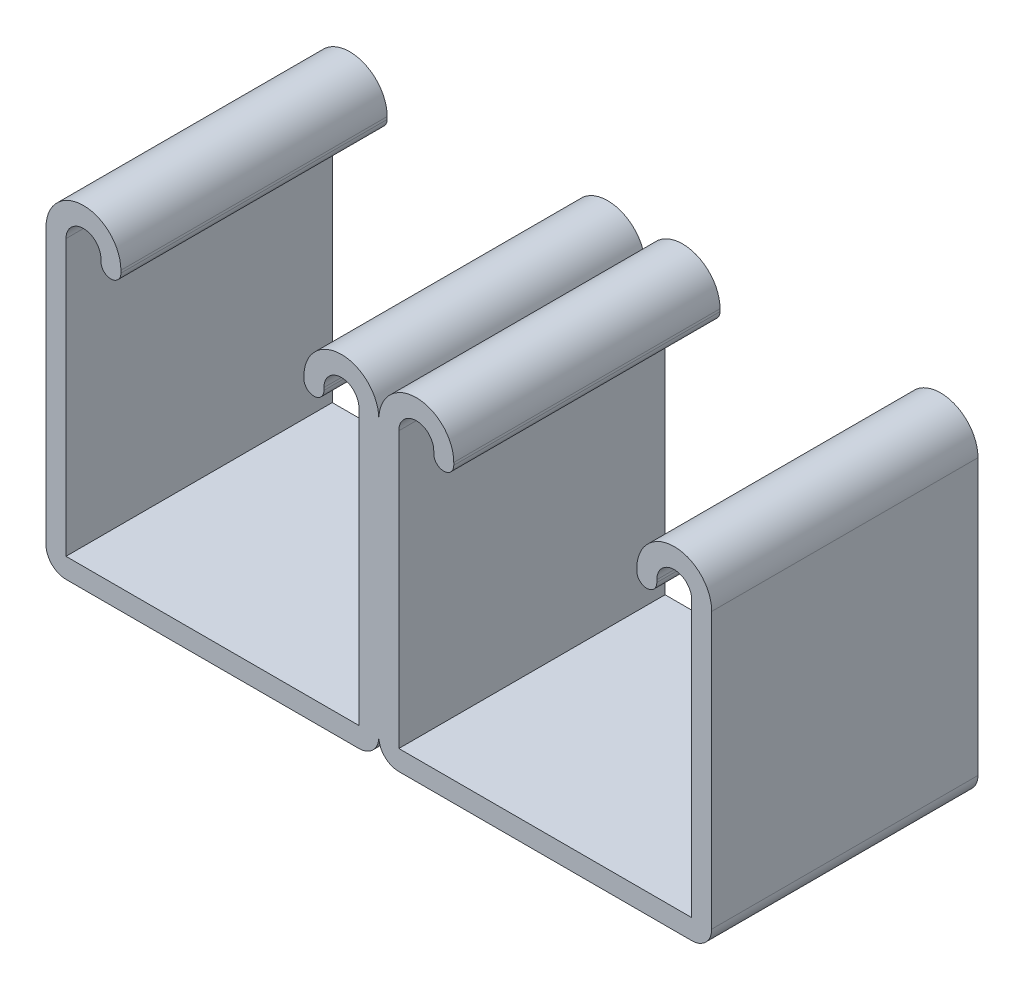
ISO-10303-21;
HEADER;
FILE_DESCRIPTION(('STEP AP214'),'2;1');
FILE_NAME('part.step','',(''),(''),'','','');
FILE_SCHEMA(('AUTOMOTIVE_DESIGN { 1 0 10303 214 1 1 1 1 }'));
ENDSEC;
DATA;
#1=APPLICATION_CONTEXT('core data for automotive mechanical design processes');
#2=APPLICATION_PROTOCOL_DEFINITION('international standard','automotive_design',2000,#1);
#3=PRODUCT_CONTEXT('',#1,'mechanical');
#4=PRODUCT('Part','Part','',(#3));
#5=PRODUCT_RELATED_PRODUCT_CATEGORY('part','',(#4));
#6=PRODUCT_DEFINITION_FORMATION('','',#4);
#7=PRODUCT_DEFINITION_CONTEXT('part definition',#1,'design');
#8=PRODUCT_DEFINITION('design','',#6,#7);
#9=PRODUCT_DEFINITION_SHAPE('','',#8);
#10=(LENGTH_UNIT() NAMED_UNIT(*) SI_UNIT(.MILLI.,.METRE.));
#11=(NAMED_UNIT(*) PLANE_ANGLE_UNIT() SI_UNIT($,.RADIAN.));
#12=(NAMED_UNIT(*) SI_UNIT($,.STERADIAN.) SOLID_ANGLE_UNIT());
#13=UNCERTAINTY_MEASURE_WITH_UNIT(LENGTH_MEASURE(1.E-05),#10,'distance_accuracy_value','');
#14=(GEOMETRIC_REPRESENTATION_CONTEXT(3) GLOBAL_UNCERTAINTY_ASSIGNED_CONTEXT((#13)) GLOBAL_UNIT_ASSIGNED_CONTEXT((#10,
#11,#12)) REPRESENTATION_CONTEXT('',''));
#15=CARTESIAN_POINT('',(0.,0.,0.));
#16=DIRECTION('',(0.,0.,1.));
#17=DIRECTION('',(1.,0.,0.));
#18=AXIS2_PLACEMENT_3D('',#15,#16,#17);
#19=CARTESIAN_POINT('',(-28.178125,14.335125,12.7));
#20=DIRECTION('',(0.,0.,-1.));
#21=DIRECTION('',(-1.,0.,0.));
#22=AXIS2_PLACEMENT_3D('',#19,#20,#21);
#23=CYLINDRICAL_SURFACE('',#22,3.571875);
#24=CARTESIAN_POINT('',(-28.178125,14.335125,-12.7));
#25=DIRECTION('',(0.,0.,1.));
#26=DIRECTION('',(-1.,0.,0.));
#27=AXIS2_PLACEMENT_3D('',#24,#25,#26);
#28=CIRCLE('',#27,3.571875);
#29=CARTESIAN_POINT('',(-24.60625,14.335125,-12.7));
#30=VERTEX_POINT('',#29);
#31=CARTESIAN_POINT('',(-31.75,14.335125,-12.7));
#32=VERTEX_POINT('',#31);
#33=EDGE_CURVE('E190',#30,#32,#28,.T.);
#34=ORIENTED_EDGE('',*,*,#33,.T.);
#35=DIRECTION('',(0.,0.,-1.));
#36=VECTOR('',#35,1.);
#37=CARTESIAN_POINT('',(-31.75,14.335125,12.7));
#38=LINE('',#37,#36);
#39=CARTESIAN_POINT('',(-31.75,14.335125,12.7));
#40=VERTEX_POINT('',#39);
#41=EDGE_CURVE('E11',#40,#32,#38,.T.);
#42=ORIENTED_EDGE('',*,*,#41,.F.);
#43=CARTESIAN_POINT('',(-28.178125,14.335125,12.7));
#44=DIRECTION('',(0.,0.,1.));
#45=DIRECTION('',(-1.,0.,0.));
#46=AXIS2_PLACEMENT_3D('',#43,#44,#45);
#47=CIRCLE('',#46,3.571875);
#48=CARTESIAN_POINT('',(-24.60625,14.335125,12.7));
#49=VERTEX_POINT('',#48);
#50=EDGE_CURVE('E223',#49,#40,#47,.T.);
#51=ORIENTED_EDGE('',*,*,#50,.F.);
#52=DIRECTION('',(0.,0.,-1.));
#53=VECTOR('',#52,1.);
#54=CARTESIAN_POINT('',(-24.60625,14.335125,12.7));
#55=LINE('',#54,#53);
#56=EDGE_CURVE('E186',#49,#30,#55,.T.);
#57=ORIENTED_EDGE('',*,*,#56,.T.);
#58=EDGE_LOOP('',(#34,#42,#51,#57));
#59=FACE_BOUND('',#58,.T.);
#60=ADVANCED_FACE('F33',(#59),#23,.T.);
#61=CARTESIAN_POINT('',(-31.75,14.335125,12.7));
#62=DIRECTION('',(1.,0.,0.));
#63=DIRECTION('',(0.,1.,0.));
#64=AXIS2_PLACEMENT_3D('',#61,#62,#63);
#65=PLANE('',#64);
#66=DIRECTION('',(0.,-1.,0.));
#67=VECTOR('',#66,1.);
#68=CARTESIAN_POINT('',(-31.75,14.335125,-12.7));
#69=LINE('',#68,#67);
#70=CARTESIAN_POINT('',(-31.75,-11.9126,-12.7));
#71=VERTEX_POINT('',#70);
#72=EDGE_CURVE('E193',#32,#71,#69,.T.);
#73=ORIENTED_EDGE('',*,*,#72,.T.);
#74=DIRECTION('',(0.,0.,-1.));
#75=VECTOR('',#74,1.);
#76=CARTESIAN_POINT('',(-31.75,-11.9126,12.7));
#77=LINE('',#76,#75);
#78=CARTESIAN_POINT('',(-31.75,-11.9126,12.7));
#79=VERTEX_POINT('',#78);
#80=EDGE_CURVE('E41',#79,#71,#77,.T.);
#81=ORIENTED_EDGE('',*,*,#80,.F.);
#82=DIRECTION('',(0.,-1.,0.));
#83=VECTOR('',#82,1.);
#84=CARTESIAN_POINT('',(-31.75,14.335125,12.7));
#85=LINE('',#84,#83);
#86=EDGE_CURVE('E120',#40,#79,#85,.T.);
#87=ORIENTED_EDGE('',*,*,#86,.F.);
#88=ORIENTED_EDGE('',*,*,#41,.T.);
#89=EDGE_LOOP('',(#73,#81,#87,#88));
#90=FACE_BOUND('',#89,.T.);
#91=ADVANCED_FACE('F330',(#90),#65,.F.);
#92=CARTESIAN_POINT('',(-29.845,-11.9126,12.7));
#93=DIRECTION('',(0.,0.,-1.));
#94=DIRECTION('',(-1.,0.,0.));
#95=AXIS2_PLACEMENT_3D('',#92,#93,#94);
#96=CYLINDRICAL_SURFACE('',#95,1.905);
#97=CARTESIAN_POINT('',(-29.845,-11.9126,-12.7));
#98=DIRECTION('',(0.,0.,1.));
#99=DIRECTION('',(-1.,0.,0.));
#100=AXIS2_PLACEMENT_3D('',#97,#98,#99);
#101=CIRCLE('',#100,1.905);
#102=CARTESIAN_POINT('',(-29.845,-13.8176,-12.7));
#103=VERTEX_POINT('',#102);
#104=EDGE_CURVE('E196',#71,#103,#101,.T.);
#105=ORIENTED_EDGE('',*,*,#104,.T.);
#106=DIRECTION('',(0.,0.,-1.));
#107=VECTOR('',#106,1.);
#108=CARTESIAN_POINT('',(-29.845,-13.8176,12.7));
#109=LINE('',#108,#107);
#110=CARTESIAN_POINT('',(-29.845,-13.8176,12.7));
#111=VERTEX_POINT('',#110);
#112=EDGE_CURVE('E260',#111,#103,#109,.T.);
#113=ORIENTED_EDGE('',*,*,#112,.F.);
#114=CARTESIAN_POINT('',(-29.845,-11.9126,12.7));
#115=DIRECTION('',(0.,0.,1.));
#116=DIRECTION('',(-1.,0.,0.));
#117=AXIS2_PLACEMENT_3D('',#114,#115,#116);
#118=CIRCLE('',#117,1.905);
#119=EDGE_CURVE('E268',#79,#111,#118,.T.);
#120=ORIENTED_EDGE('',*,*,#119,.F.);
#121=ORIENTED_EDGE('',*,*,#80,.T.);
#122=EDGE_LOOP('',(#105,#113,#120,#121));
#123=FACE_BOUND('',#122,.T.);
#124=ADVANCED_FACE('F266',(#123),#96,.T.);
#125=CARTESIAN_POINT('',(-29.845,-13.8176,12.7));
#126=DIRECTION('',(0.,1.,0.));
#127=DIRECTION('',(0.,0.,1.));
#128=AXIS2_PLACEMENT_3D('',#125,#126,#127);
#129=PLANE('',#128);
#130=DIRECTION('',(1.,0.,0.));
#131=VECTOR('',#130,1.);
#132=CARTESIAN_POINT('',(-29.845,-13.8176,-12.7));
#133=LINE('',#132,#131);
#134=CARTESIAN_POINT('',(-1.905,-13.8176,-12.7));
#135=VERTEX_POINT('',#134);
#136=EDGE_CURVE('E198',#103,#135,#133,.T.);
#137=ORIENTED_EDGE('',*,*,#136,.T.);
#138=DIRECTION('',(0.,0.,-1.));
#139=VECTOR('',#138,1.);
#140=CARTESIAN_POINT('',(-1.905,-13.8176,12.7));
#141=LINE('',#140,#139);
#142=CARTESIAN_POINT('',(-1.905,-13.8176,12.7));
#143=VERTEX_POINT('',#142);
#144=EDGE_CURVE('E257',#143,#135,#141,.T.);
#145=ORIENTED_EDGE('',*,*,#144,.F.);
#146=DIRECTION('',(1.,0.,0.));
#147=VECTOR('',#146,1.);
#148=CARTESIAN_POINT('',(-29.845,-13.8176,12.7));
#149=LINE('',#148,#147);
#150=EDGE_CURVE('E287',#111,#143,#149,.T.);
#151=ORIENTED_EDGE('',*,*,#150,.F.);
#152=ORIENTED_EDGE('',*,*,#112,.T.);
#153=EDGE_LOOP('',(#137,#145,#151,#152));
#154=FACE_BOUND('',#153,.T.);
#155=ADVANCED_FACE('F277',(#154),#129,.F.);
#156=CARTESIAN_POINT('',(-1.905,-11.9126,12.7));
#157=DIRECTION('',(0.,0.,-1.));
#158=DIRECTION('',(-1.,0.,0.));
#159=AXIS2_PLACEMENT_3D('',#156,#157,#158);
#160=CYLINDRICAL_SURFACE('',#159,1.905);
#161=CARTESIAN_POINT('',(-1.905,-11.9126,-12.7));
#162=DIRECTION('',(0.,0.,1.));
#163=DIRECTION('',(1.,0.,0.));
#164=AXIS2_PLACEMENT_3D('',#161,#162,#163);
#165=CIRCLE('',#164,1.905);
#166=CARTESIAN_POINT('',(0.,-11.9126,-12.7));
#167=VERTEX_POINT('',#166);
#168=EDGE_CURVE('E200',#135,#167,#165,.T.);
#169=ORIENTED_EDGE('',*,*,#168,.T.);
#170=DIRECTION('',(0.,0.,-1.));
#171=VECTOR('',#170,1.);
#172=CARTESIAN_POINT('',(0.,-11.9126,12.7));
#173=LINE('',#172,#171);
#174=CARTESIAN_POINT('',(0.,-11.9126,12.7));
#175=VERTEX_POINT('',#174);
#176=EDGE_CURVE('E254',#175,#167,#173,.T.);
#177=ORIENTED_EDGE('',*,*,#176,.F.);
#178=CARTESIAN_POINT('',(-1.905,-11.9126,12.7));
#179=DIRECTION('',(0.,0.,1.));
#180=DIRECTION('',(1.,0.,0.));
#181=AXIS2_PLACEMENT_3D('',#178,#179,#180);
#182=CIRCLE('',#181,1.905);
#183=EDGE_CURVE('E283',#143,#175,#182,.T.);
#184=ORIENTED_EDGE('',*,*,#183,.F.);
#185=ORIENTED_EDGE('',*,*,#144,.T.);
#186=EDGE_LOOP('',(#169,#177,#184,#185));
#187=FACE_BOUND('',#186,.T.);
#188=ADVANCED_FACE('F281',(#187),#160,.T.);
#189=CARTESIAN_POINT('',(-3.571875,14.335125,12.7));
#190=DIRECTION('',(0.,0.,-1.));
#191=DIRECTION('',(-1.,0.,0.));
#192=AXIS2_PLACEMENT_3D('',#189,#190,#191);
#193=CYLINDRICAL_SURFACE('',#192,3.571875);
#194=CARTESIAN_POINT('',(-3.571875,14.335125,-12.7));
#195=DIRECTION('',(0.,0.,1.));
#196=DIRECTION('',(1.,0.,0.));
#197=AXIS2_PLACEMENT_3D('',#194,#195,#196);
#198=CIRCLE('',#197,3.571875);
#199=CARTESIAN_POINT('',(0.,14.335125,-12.7));
#200=VERTEX_POINT('',#199);
#201=CARTESIAN_POINT('',(-7.14375,14.335125,-12.7));
#202=VERTEX_POINT('',#201);
#203=EDGE_CURVE('E202',#200,#202,#198,.T.);
#204=ORIENTED_EDGE('',*,*,#203,.T.);
#205=DIRECTION('',(0.,0.,-1.));
#206=VECTOR('',#205,1.);
#207=CARTESIAN_POINT('',(-7.14375,14.335125,12.7));
#208=LINE('',#207,#206);
#209=CARTESIAN_POINT('',(-7.14375,14.335125,12.7));
#210=VERTEX_POINT('',#209);
#211=EDGE_CURVE('E248',#210,#202,#208,.T.);
#212=ORIENTED_EDGE('',*,*,#211,.F.);
#213=CARTESIAN_POINT('',(-3.571875,14.335125,12.7));
#214=DIRECTION('',(0.,0.,1.));
#215=DIRECTION('',(1.,0.,0.));
#216=AXIS2_PLACEMENT_3D('',#213,#214,#215);
#217=CIRCLE('',#216,3.571875);
#218=CARTESIAN_POINT('',(0.,14.335125,12.7));
#219=VERTEX_POINT('',#218);
#220=EDGE_CURVE('E286',#219,#210,#217,.T.);
#221=ORIENTED_EDGE('',*,*,#220,.F.);
#222=DIRECTION('',(0.,0.,-1.));
#223=VECTOR('',#222,1.);
#224=CARTESIAN_POINT('',(0.,14.335125,12.7));
#225=LINE('',#224,#223);
#226=EDGE_CURVE('E251',#219,#200,#225,.T.);
#227=ORIENTED_EDGE('',*,*,#226,.T.);
#228=EDGE_LOOP('',(#204,#212,#221,#227));
#229=FACE_BOUND('',#228,.T.);
#230=ADVANCED_FACE('F343',(#229),#193,.T.);
#231=CARTESIAN_POINT('',(-7.14375,14.335125,12.7));
#232=DIRECTION('',(1.,0.,0.));
#233=DIRECTION('',(0.,1.,0.));
#234=AXIS2_PLACEMENT_3D('',#231,#232,#233);
#235=PLANE('',#234);
#236=DIRECTION('',(0.,-1.,0.));
#237=VECTOR('',#236,1.);
#238=CARTESIAN_POINT('',(-7.14375,14.335125,-12.7));
#239=LINE('',#238,#237);
#240=CARTESIAN_POINT('',(-7.14375,14.097,-12.7));
#241=VERTEX_POINT('',#240);
#242=EDGE_CURVE('E204',#202,#241,#239,.T.);
#243=ORIENTED_EDGE('',*,*,#242,.T.);
#244=DIRECTION('',(0.,0.,-1.));
#245=VECTOR('',#244,1.);
#246=CARTESIAN_POINT('',(-7.14375,14.097,12.7));
#247=LINE('',#246,#245);
#248=CARTESIAN_POINT('',(-7.14375,14.097,12.7));
#249=VERTEX_POINT('',#248);
#250=EDGE_CURVE('E245',#249,#241,#247,.T.);
#251=ORIENTED_EDGE('',*,*,#250,.F.);
#252=DIRECTION('',(0.,-1.,0.));
#253=VECTOR('',#252,1.);
#254=CARTESIAN_POINT('',(-7.14375,14.335125,12.7));
#255=LINE('',#254,#253);
#256=EDGE_CURVE('E289',#210,#249,#255,.T.);
#257=ORIENTED_EDGE('',*,*,#256,.F.);
#258=ORIENTED_EDGE('',*,*,#211,.T.);
#259=EDGE_LOOP('',(#243,#251,#257,#258));
#260=FACE_BOUND('',#259,.T.);
#261=ADVANCED_FACE('F346',(#260),#235,.F.);
#262=CARTESIAN_POINT('',(-6.19125,14.097,12.7));
#263=DIRECTION('',(0.,0.,-1.));
#264=DIRECTION('',(-1.,0.,0.));
#265=AXIS2_PLACEMENT_3D('',#262,#263,#264);
#266=CYLINDRICAL_SURFACE('',#265,0.9525);
#267=CARTESIAN_POINT('',(-6.19125,14.097,-12.7));
#268=DIRECTION('',(0.,0.,1.));
#269=DIRECTION('',(1.,0.,0.));
#270=AXIS2_PLACEMENT_3D('',#267,#268,#269);
#271=CIRCLE('',#270,0.9525);
#272=CARTESIAN_POINT('',(-5.23875,14.097,-12.7));
#273=VERTEX_POINT('',#272);
#274=EDGE_CURVE('E206',#241,#273,#271,.T.);
#275=ORIENTED_EDGE('',*,*,#274,.T.);
#276=DIRECTION('',(0.,0.,-1.));
#277=VECTOR('',#276,1.);
#278=CARTESIAN_POINT('',(-5.23875,14.097,12.7));
#279=LINE('',#278,#277);
#280=CARTESIAN_POINT('',(-5.23875,14.097,12.7));
#281=VERTEX_POINT('',#280);
#282=EDGE_CURVE('E242',#281,#273,#279,.T.);
#283=ORIENTED_EDGE('',*,*,#282,.F.);
#284=CARTESIAN_POINT('',(-6.19125,14.097,12.7));
#285=DIRECTION('',(0.,0.,1.));
#286=DIRECTION('',(1.,0.,0.));
#287=AXIS2_PLACEMENT_3D('',#284,#285,#286);
#288=CIRCLE('',#287,0.9525);
#289=EDGE_CURVE('E295',#249,#281,#288,.T.);
#290=ORIENTED_EDGE('',*,*,#289,.F.);
#291=ORIENTED_EDGE('',*,*,#250,.T.);
#292=EDGE_LOOP('',(#275,#283,#290,#291));
#293=FACE_BOUND('',#292,.T.);
#294=ADVANCED_FACE('F350',(#293),#266,.T.);
#295=CARTESIAN_POINT('',(-5.23875,14.335125,12.7));
#296=DIRECTION('',(-1.,0.,0.));
#297=DIRECTION('',(0.,-1.,0.));
#298=AXIS2_PLACEMENT_3D('',#295,#296,#297);
#299=PLANE('',#298);
#300=DIRECTION('',(0.,1.,0.));
#301=VECTOR('',#300,1.);
#302=CARTESIAN_POINT('',(-5.23875,14.335125,-12.7));
#303=LINE('',#302,#301);
#304=CARTESIAN_POINT('',(-5.23875,14.335125,-12.7));
#305=VERTEX_POINT('',#304);
#306=EDGE_CURVE('E208',#273,#305,#303,.T.);
#307=ORIENTED_EDGE('',*,*,#306,.T.);
#308=DIRECTION('',(0.,0.,-1.));
#309=VECTOR('',#308,1.);
#310=CARTESIAN_POINT('',(-5.23875,14.335125,12.7));
#311=LINE('',#310,#309);
#312=CARTESIAN_POINT('',(-5.23875,14.335125,12.7));
#313=VERTEX_POINT('',#312);
#314=EDGE_CURVE('E239',#313,#305,#311,.T.);
#315=ORIENTED_EDGE('',*,*,#314,.F.);
#316=DIRECTION('',(0.,1.,0.));
#317=VECTOR('',#316,1.);
#318=CARTESIAN_POINT('',(-5.23875,14.335125,12.7));
#319=LINE('',#318,#317);
#320=EDGE_CURVE('E297',#281,#313,#319,.T.);
#321=ORIENTED_EDGE('',*,*,#320,.F.);
#322=ORIENTED_EDGE('',*,*,#282,.T.);
#323=EDGE_LOOP('',(#307,#315,#321,#322));
#324=FACE_BOUND('',#323,.T.);
#325=ADVANCED_FACE('F354',(#324),#299,.F.);
#326=CARTESIAN_POINT('',(-3.571875,14.335125,12.7));
#327=DIRECTION('',(0.,0.,-1.));
#328=DIRECTION('',(-1.,0.,0.));
#329=AXIS2_PLACEMENT_3D('',#326,#327,#328);
#330=CYLINDRICAL_SURFACE('',#329,1.666875);
#331=CARTESIAN_POINT('',(-3.571875,14.335125,-12.7));
#332=DIRECTION('',(0.,0.,-1.));
#333=DIRECTION('',(1.,0.,0.));
#334=AXIS2_PLACEMENT_3D('',#331,#332,#333);
#335=CIRCLE('',#334,1.666875);
#336=CARTESIAN_POINT('',(-1.905,14.335125,-12.7));
#337=VERTEX_POINT('',#336);
#338=EDGE_CURVE('E210',#305,#337,#335,.T.);
#339=ORIENTED_EDGE('',*,*,#338,.T.);
#340=DIRECTION('',(0.,0.,-1.));
#341=VECTOR('',#340,1.);
#342=CARTESIAN_POINT('',(-1.905,14.335125,12.7));
#343=LINE('',#342,#341);
#344=CARTESIAN_POINT('',(-1.905,14.335125,12.7));
#345=VERTEX_POINT('',#344);
#346=EDGE_CURVE('E236',#345,#337,#343,.T.);
#347=ORIENTED_EDGE('',*,*,#346,.F.);
#348=CARTESIAN_POINT('',(-3.571875,14.335125,12.7));
#349=DIRECTION('',(0.,0.,-1.));
#350=DIRECTION('',(1.,0.,0.));
#351=AXIS2_PLACEMENT_3D('',#348,#349,#350);
#352=CIRCLE('',#351,1.666875);
#353=EDGE_CURVE('E299',#313,#345,#352,.T.);
#354=ORIENTED_EDGE('',*,*,#353,.F.);
#355=ORIENTED_EDGE('',*,*,#314,.T.);
#356=EDGE_LOOP('',(#339,#347,#354,#355));
#357=FACE_BOUND('',#356,.T.);
#358=ADVANCED_FACE('F358',(#357),#330,.F.);
#359=CARTESIAN_POINT('',(-1.905,-11.9126,12.7));
#360=DIRECTION('',(1.,0.,0.));
#361=DIRECTION('',(0.,0.,-1.));
#362=AXIS2_PLACEMENT_3D('',#359,#360,#361);
#363=PLANE('',#362);
#364=DIRECTION('',(0.,-1.,0.));
#365=VECTOR('',#364,1.);
#366=CARTESIAN_POINT('',(-1.905,-11.9126,-12.7));
#367=LINE('',#366,#365);
#368=CARTESIAN_POINT('',(-1.905,-11.9126,-12.7));
#369=VERTEX_POINT('',#368);
#370=EDGE_CURVE('E212',#337,#369,#367,.T.);
#371=ORIENTED_EDGE('',*,*,#370,.T.);
#372=DIRECTION('',(0.,0.,-1.));
#373=VECTOR('',#372,1.);
#374=CARTESIAN_POINT('',(-1.905,-11.9126,12.7));
#375=LINE('',#374,#373);
#376=CARTESIAN_POINT('',(-1.905,-11.9126,12.7));
#377=VERTEX_POINT('',#376);
#378=EDGE_CURVE('E233',#377,#369,#375,.T.);
#379=ORIENTED_EDGE('',*,*,#378,.F.);
#380=DIRECTION('',(0.,-1.,0.));
#381=VECTOR('',#380,1.);
#382=CARTESIAN_POINT('',(-1.905,-11.9126,12.7));
#383=LINE('',#382,#381);
#384=EDGE_CURVE('E301',#345,#377,#383,.T.);
#385=ORIENTED_EDGE('',*,*,#384,.F.);
#386=ORIENTED_EDGE('',*,*,#346,.T.);
#387=EDGE_LOOP('',(#371,#379,#385,#386));
#388=FACE_BOUND('',#387,.T.);
#389=ADVANCED_FACE('F362',(#388),#363,.F.);
#390=CARTESIAN_POINT('',(-29.845,-11.9126,12.7));
#391=DIRECTION('',(0.,-1.,0.));
#392=DIRECTION('',(0.,0.,-1.));
#393=AXIS2_PLACEMENT_3D('',#390,#391,#392);
#394=PLANE('',#393);
#395=DIRECTION('',(-1.,0.,0.));
#396=VECTOR('',#395,1.);
#397=CARTESIAN_POINT('',(-29.845,-11.9126,-12.7));
#398=LINE('',#397,#396);
#399=CARTESIAN_POINT('',(-29.845,-11.9126,-12.7));
#400=VERTEX_POINT('',#399);
#401=EDGE_CURVE('E214',#369,#400,#398,.T.);
#402=ORIENTED_EDGE('',*,*,#401,.T.);
#403=DIRECTION('',(0.,0.,-1.));
#404=VECTOR('',#403,1.);
#405=CARTESIAN_POINT('',(-29.845,-11.9126,12.7));
#406=LINE('',#405,#404);
#407=CARTESIAN_POINT('',(-29.845,-11.9126,12.7));
#408=VERTEX_POINT('',#407);
#409=EDGE_CURVE('E230',#408,#400,#406,.T.);
#410=ORIENTED_EDGE('',*,*,#409,.F.);
#411=DIRECTION('',(-1.,0.,0.));
#412=VECTOR('',#411,1.);
#413=CARTESIAN_POINT('',(-29.845,-11.9126,12.7));
#414=LINE('',#413,#412);
#415=EDGE_CURVE('E303',#377,#408,#414,.T.);
#416=ORIENTED_EDGE('',*,*,#415,.F.);
#417=ORIENTED_EDGE('',*,*,#378,.T.);
#418=EDGE_LOOP('',(#402,#410,#416,#417));
#419=FACE_BOUND('',#418,.T.);
#420=ADVANCED_FACE('F366',(#419),#394,.F.);
#421=CARTESIAN_POINT('',(-29.845,14.335125,12.7));
#422=DIRECTION('',(-1.,0.,0.));
#423=DIRECTION('',(0.,0.,1.));
#424=AXIS2_PLACEMENT_3D('',#421,#422,#423);
#425=PLANE('',#424);
#426=DIRECTION('',(0.,1.,0.));
#427=VECTOR('',#426,1.);
#428=CARTESIAN_POINT('',(-29.845,14.335125,-12.7));
#429=LINE('',#428,#427);
#430=CARTESIAN_POINT('',(-29.845,14.335125,-12.7));
#431=VERTEX_POINT('',#430);
#432=EDGE_CURVE('E216',#400,#431,#429,.T.);
#433=ORIENTED_EDGE('',*,*,#432,.T.);
#434=DIRECTION('',(0.,0.,-1.));
#435=VECTOR('',#434,1.);
#436=CARTESIAN_POINT('',(-29.845,14.335125,12.7));
#437=LINE('',#436,#435);
#438=CARTESIAN_POINT('',(-29.845,14.335125,12.7));
#439=VERTEX_POINT('',#438);
#440=EDGE_CURVE('E227',#439,#431,#437,.T.);
#441=ORIENTED_EDGE('',*,*,#440,.F.);
#442=DIRECTION('',(0.,1.,0.));
#443=VECTOR('',#442,1.);
#444=CARTESIAN_POINT('',(-29.845,14.335125,12.7));
#445=LINE('',#444,#443);
#446=EDGE_CURVE('E305',#408,#439,#445,.T.);
#447=ORIENTED_EDGE('',*,*,#446,.F.);
#448=ORIENTED_EDGE('',*,*,#409,.T.);
#449=EDGE_LOOP('',(#433,#441,#447,#448));
#450=FACE_BOUND('',#449,.T.);
#451=ADVANCED_FACE('F311',(#450),#425,.F.);
#452=CARTESIAN_POINT('',(-28.178125,14.335125,12.7));
#453=DIRECTION('',(0.,0.,-1.));
#454=DIRECTION('',(-1.,0.,0.));
#455=AXIS2_PLACEMENT_3D('',#452,#453,#454);
#456=CYLINDRICAL_SURFACE('',#455,1.666875);
#457=CARTESIAN_POINT('',(-28.178125,14.335125,-12.7));
#458=DIRECTION('',(0.,0.,-1.));
#459=DIRECTION('',(-1.,0.,0.));
#460=AXIS2_PLACEMENT_3D('',#457,#458,#459);
#461=CIRCLE('',#460,1.666875);
#462=CARTESIAN_POINT('',(-26.51125,14.335125,-12.7));
#463=VERTEX_POINT('',#462);
#464=EDGE_CURVE('E218',#431,#463,#461,.T.);
#465=ORIENTED_EDGE('',*,*,#464,.T.);
#466=DIRECTION('',(0.,0.,-1.));
#467=VECTOR('',#466,1.);
#468=CARTESIAN_POINT('',(-26.51125,14.335125,12.7));
#469=LINE('',#468,#467);
#470=CARTESIAN_POINT('',(-26.51125,14.335125,12.7));
#471=VERTEX_POINT('',#470);
#472=EDGE_CURVE('E181',#471,#463,#469,.T.);
#473=ORIENTED_EDGE('',*,*,#472,.F.);
#474=CARTESIAN_POINT('',(-28.178125,14.335125,12.7));
#475=DIRECTION('',(0.,0.,-1.));
#476=DIRECTION('',(-1.,0.,0.));
#477=AXIS2_PLACEMENT_3D('',#474,#475,#476);
#478=CIRCLE('',#477,1.666875);
#479=EDGE_CURVE('E172',#439,#471,#478,.T.);
#480=ORIENTED_EDGE('',*,*,#479,.F.);
#481=ORIENTED_EDGE('',*,*,#440,.T.);
#482=EDGE_LOOP('',(#465,#473,#480,#481));
#483=FACE_BOUND('',#482,.T.);
#484=ADVANCED_FACE('F315',(#483),#456,.F.);
#485=CARTESIAN_POINT('',(-26.51125,14.335125,12.7));
#486=DIRECTION('',(1.,0.,0.));
#487=DIRECTION('',(0.,1.,0.));
#488=AXIS2_PLACEMENT_3D('',#485,#486,#487);
#489=PLANE('',#488);
#490=DIRECTION('',(0.,-1.,0.));
#491=VECTOR('',#490,1.);
#492=CARTESIAN_POINT('',(-26.51125,14.335125,-12.7));
#493=LINE('',#492,#491);
#494=CARTESIAN_POINT('',(-26.51125,14.097,-12.7));
#495=VERTEX_POINT('',#494);
#496=EDGE_CURVE('E180',#463,#495,#493,.T.);
#497=ORIENTED_EDGE('',*,*,#496,.T.);
#498=DIRECTION('',(0.,0.,-1.));
#499=VECTOR('',#498,1.);
#500=CARTESIAN_POINT('',(-26.51125,14.097,12.7));
#501=LINE('',#500,#499);
#502=CARTESIAN_POINT('',(-26.51125,14.097,12.7));
#503=VERTEX_POINT('',#502);
#504=EDGE_CURVE('E177',#503,#495,#501,.T.);
#505=ORIENTED_EDGE('',*,*,#504,.F.);
#506=DIRECTION('',(0.,-1.,0.));
#507=VECTOR('',#506,1.);
#508=CARTESIAN_POINT('',(-26.51125,14.335125,12.7));
#509=LINE('',#508,#507);
#510=EDGE_CURVE('E166',#471,#503,#509,.T.);
#511=ORIENTED_EDGE('',*,*,#510,.F.);
#512=ORIENTED_EDGE('',*,*,#472,.T.);
#513=EDGE_LOOP('',(#497,#505,#511,#512));
#514=FACE_BOUND('',#513,.T.);
#515=ADVANCED_FACE('F178',(#514),#489,.F.);
#516=CARTESIAN_POINT('',(-25.55875,14.097,12.7));
#517=DIRECTION('',(0.,0.,-1.));
#518=DIRECTION('',(-1.,0.,0.));
#519=AXIS2_PLACEMENT_3D('',#516,#517,#518);
#520=CYLINDRICAL_SURFACE('',#519,0.9525);
#521=CARTESIAN_POINT('',(-25.55875,14.097,-12.7));
#522=DIRECTION('',(0.,0.,1.));
#523=DIRECTION('',(-1.,0.,0.));
#524=AXIS2_PLACEMENT_3D('',#521,#522,#523);
#525=CIRCLE('',#524,0.9525);
#526=CARTESIAN_POINT('',(-24.60625,14.097,-12.7));
#527=VERTEX_POINT('',#526);
#528=EDGE_CURVE('E106',#495,#527,#525,.T.);
#529=ORIENTED_EDGE('',*,*,#528,.T.);
#530=DIRECTION('',(0.,0.,-1.));
#531=VECTOR('',#530,1.);
#532=CARTESIAN_POINT('',(-24.60625,14.097,12.7));
#533=LINE('',#532,#531);
#534=CARTESIAN_POINT('',(-24.60625,14.097,12.7));
#535=VERTEX_POINT('',#534);
#536=EDGE_CURVE('E182',#535,#527,#533,.T.);
#537=ORIENTED_EDGE('',*,*,#536,.F.);
#538=CARTESIAN_POINT('',(-25.55875,14.097,12.7));
#539=DIRECTION('',(0.,0.,1.));
#540=DIRECTION('',(-1.,0.,0.));
#541=AXIS2_PLACEMENT_3D('',#538,#539,#540);
#542=CIRCLE('',#541,0.9525);
#543=EDGE_CURVE('E170',#503,#535,#542,.T.);
#544=ORIENTED_EDGE('',*,*,#543,.F.);
#545=ORIENTED_EDGE('',*,*,#504,.T.);
#546=EDGE_LOOP('',(#529,#537,#544,#545));
#547=FACE_BOUND('',#546,.T.);
#548=ADVANCED_FACE('F184',(#547),#520,.T.);
#549=CARTESIAN_POINT('',(-24.60625,14.335125,12.7));
#550=DIRECTION('',(-1.,0.,0.));
#551=DIRECTION('',(0.,-1.,0.));
#552=AXIS2_PLACEMENT_3D('',#549,#550,#551);
#553=PLANE('',#552);
#554=DIRECTION('',(0.,1.,0.));
#555=VECTOR('',#554,1.);
#556=CARTESIAN_POINT('',(-24.60625,14.335125,-12.7));
#557=LINE('',#556,#555);
#558=EDGE_CURVE('E112',#527,#30,#557,.T.);
#559=ORIENTED_EDGE('',*,*,#558,.T.);
#560=ORIENTED_EDGE('',*,*,#56,.F.);
#561=DIRECTION('',(0.,1.,0.));
#562=VECTOR('',#561,1.);
#563=CARTESIAN_POINT('',(-24.60625,14.335125,12.7));
#564=LINE('',#563,#562);
#565=EDGE_CURVE('E49',#535,#49,#564,.T.);
#566=ORIENTED_EDGE('',*,*,#565,.F.);
#567=ORIENTED_EDGE('',*,*,#536,.T.);
#568=EDGE_LOOP('',(#559,#560,#566,#567));
#569=FACE_BOUND('',#568,.T.);
#570=ADVANCED_FACE('F319',(#569),#553,.F.);
#571=CARTESIAN_POINT('',(-28.178125,14.335125,12.7));
#572=DIRECTION('',(0.,0.,-1.));
#573=DIRECTION('',(-1.,0.,0.));
#574=AXIS2_PLACEMENT_3D('',#571,#572,#573);
#575=PLANE('',#574);
#576=ORIENTED_EDGE('',*,*,#50,.T.);
#577=ORIENTED_EDGE('',*,*,#86,.T.);
#578=ORIENTED_EDGE('',*,*,#119,.T.);
#579=ORIENTED_EDGE('',*,*,#150,.T.);
#580=ORIENTED_EDGE('',*,*,#183,.T.);
#581=CARTESIAN_POINT('',(1.90500000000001,-11.9126,12.7));
#582=DIRECTION('',(0.,0.,1.));
#583=DIRECTION('',(-1.,0.,0.));
#584=AXIS2_PLACEMENT_3D('',#581,#582,#583);
#585=CIRCLE('',#584,1.905);
#586=CARTESIAN_POINT('',(1.90500000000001,-13.8176,12.7));
#587=VERTEX_POINT('',#586);
#588=EDGE_CURVE('E830',#175,#587,#585,.T.);
#589=ORIENTED_EDGE('',*,*,#588,.T.);
#590=DIRECTION('',(1.,0.,0.));
#591=VECTOR('',#590,1.);
#592=CARTESIAN_POINT('',(1.90500000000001,-13.8176,12.7));
#593=LINE('',#592,#591);
#594=CARTESIAN_POINT('',(29.845,-13.8176,12.7));
#595=VERTEX_POINT('',#594);
#596=EDGE_CURVE('E716',#587,#595,#593,.T.);
#597=ORIENTED_EDGE('',*,*,#596,.T.);
#598=CARTESIAN_POINT('',(29.845,-11.9126,12.7));
#599=DIRECTION('',(0.,0.,1.));
#600=DIRECTION('',(1.,0.,0.));
#601=AXIS2_PLACEMENT_3D('',#598,#599,#600);
#602=CIRCLE('',#601,1.905);
#603=CARTESIAN_POINT('',(31.75,-11.9126,12.7));
#604=VERTEX_POINT('',#603);
#605=EDGE_CURVE('E739',#595,#604,#602,.T.);
#606=ORIENTED_EDGE('',*,*,#605,.T.);
#607=DIRECTION('',(0.,1.,0.));
#608=VECTOR('',#607,1.);
#609=CARTESIAN_POINT('',(31.75,-11.9126,12.7));
#610=LINE('',#609,#608);
#611=CARTESIAN_POINT('',(31.75,14.335125,12.7));
#612=VERTEX_POINT('',#611);
#613=EDGE_CURVE('E731',#604,#612,#610,.T.);
#614=ORIENTED_EDGE('',*,*,#613,.T.);
#615=CARTESIAN_POINT('',(28.178125,14.335125,12.7));
#616=DIRECTION('',(0.,0.,1.));
#617=DIRECTION('',(1.,0.,0.));
#618=AXIS2_PLACEMENT_3D('',#615,#616,#617);
#619=CIRCLE('',#618,3.571875);
#620=CARTESIAN_POINT('',(24.60625,14.335125,12.7));
#621=VERTEX_POINT('',#620);
#622=EDGE_CURVE('E738',#612,#621,#619,.T.);
#623=ORIENTED_EDGE('',*,*,#622,.T.);
#624=DIRECTION('',(0.,-1.,0.));
#625=VECTOR('',#624,1.);
#626=CARTESIAN_POINT('',(24.60625,14.335125,12.7));
#627=LINE('',#626,#625);
#628=CARTESIAN_POINT('',(24.60625,14.097,12.7));
#629=VERTEX_POINT('',#628);
#630=EDGE_CURVE('E741',#621,#629,#627,.T.);
#631=ORIENTED_EDGE('',*,*,#630,.T.);
#632=CARTESIAN_POINT('',(25.55875,14.097,12.7));
#633=DIRECTION('',(0.,0.,1.));
#634=DIRECTION('',(1.,0.,0.));
#635=AXIS2_PLACEMENT_3D('',#632,#633,#634);
#636=CIRCLE('',#635,0.9525);
#637=CARTESIAN_POINT('',(26.51125,14.097,12.7));
#638=VERTEX_POINT('',#637);
#639=EDGE_CURVE('E748',#629,#638,#636,.T.);
#640=ORIENTED_EDGE('',*,*,#639,.T.);
#641=DIRECTION('',(0.,1.,0.));
#642=VECTOR('',#641,1.);
#643=CARTESIAN_POINT('',(26.51125,14.335125,12.7));
#644=LINE('',#643,#642);
#645=CARTESIAN_POINT('',(26.51125,14.335125,12.7));
#646=VERTEX_POINT('',#645);
#647=EDGE_CURVE('E751',#638,#646,#644,.T.);
#648=ORIENTED_EDGE('',*,*,#647,.T.);
#649=CARTESIAN_POINT('',(28.178125,14.335125,12.7));
#650=DIRECTION('',(0.,0.,-1.));
#651=DIRECTION('',(1.,0.,0.));
#652=AXIS2_PLACEMENT_3D('',#649,#650,#651);
#653=CIRCLE('',#652,1.666875);
#654=CARTESIAN_POINT('',(29.845,14.335125,12.7));
#655=VERTEX_POINT('',#654);
#656=EDGE_CURVE('E754',#646,#655,#653,.T.);
#657=ORIENTED_EDGE('',*,*,#656,.T.);
#658=DIRECTION('',(0.,-1.,0.));
#659=VECTOR('',#658,1.);
#660=CARTESIAN_POINT('',(29.845,-11.9126,12.7));
#661=LINE('',#660,#659);
#662=CARTESIAN_POINT('',(29.845,-11.9126,12.7));
#663=VERTEX_POINT('',#662);
#664=EDGE_CURVE('E757',#655,#663,#661,.T.);
#665=ORIENTED_EDGE('',*,*,#664,.T.);
#666=DIRECTION('',(-1.,0.,0.));
#667=VECTOR('',#666,1.);
#668=CARTESIAN_POINT('',(1.905,-11.9126,12.7));
#669=LINE('',#668,#667);
#670=CARTESIAN_POINT('',(1.905,-11.9126,12.7));
#671=VERTEX_POINT('',#670);
#672=EDGE_CURVE('E760',#663,#671,#669,.T.);
#673=ORIENTED_EDGE('',*,*,#672,.T.);
#674=DIRECTION('',(0.,1.,0.));
#675=VECTOR('',#674,1.);
#676=CARTESIAN_POINT('',(1.905,14.335125,12.7));
#677=LINE('',#676,#675);
#678=CARTESIAN_POINT('',(1.905,14.335125,12.7));
#679=VERTEX_POINT('',#678);
#680=EDGE_CURVE('E763',#671,#679,#677,.T.);
#681=ORIENTED_EDGE('',*,*,#680,.T.);
#682=CARTESIAN_POINT('',(3.571875,14.335125,12.7));
#683=DIRECTION('',(0.,0.,-1.));
#684=DIRECTION('',(-1.,0.,0.));
#685=AXIS2_PLACEMENT_3D('',#682,#683,#684);
#686=CIRCLE('',#685,1.666875);
#687=CARTESIAN_POINT('',(5.23875,14.335125,12.7));
#688=VERTEX_POINT('',#687);
#689=EDGE_CURVE('E766',#679,#688,#686,.T.);
#690=ORIENTED_EDGE('',*,*,#689,.T.);
#691=DIRECTION('',(0.,-1.,0.));
#692=VECTOR('',#691,1.);
#693=CARTESIAN_POINT('',(5.23875,14.335125,12.7));
#694=LINE('',#693,#692);
#695=CARTESIAN_POINT('',(5.23875,14.097,12.7));
#696=VERTEX_POINT('',#695);
#697=EDGE_CURVE('E769',#688,#696,#694,.T.);
#698=ORIENTED_EDGE('',*,*,#697,.T.);
#699=CARTESIAN_POINT('',(6.19125,14.097,12.7));
#700=DIRECTION('',(0.,0.,1.));
#701=DIRECTION('',(-1.,0.,0.));
#702=AXIS2_PLACEMENT_3D('',#699,#700,#701);
#703=CIRCLE('',#702,0.9525);
#704=CARTESIAN_POINT('',(7.14375,14.097,12.7));
#705=VERTEX_POINT('',#704);
#706=EDGE_CURVE('E771',#696,#705,#703,.T.);
#707=ORIENTED_EDGE('',*,*,#706,.T.);
#708=DIRECTION('',(0.,1.,0.));
#709=VECTOR('',#708,1.);
#710=CARTESIAN_POINT('',(7.14375,14.335125,12.7));
#711=LINE('',#710,#709);
#712=CARTESIAN_POINT('',(7.14375,14.335125,12.7));
#713=VERTEX_POINT('',#712);
#714=EDGE_CURVE('E614',#705,#713,#711,.T.);
#715=ORIENTED_EDGE('',*,*,#714,.T.);
#716=CARTESIAN_POINT('',(3.571875,14.335125,12.7));
#717=DIRECTION('',(0.,0.,1.));
#718=DIRECTION('',(-1.,0.,0.));
#719=AXIS2_PLACEMENT_3D('',#716,#717,#718);
#720=CIRCLE('',#719,3.571875);
#721=EDGE_CURVE('E606',#713,#219,#720,.T.);
#722=ORIENTED_EDGE('',*,*,#721,.T.);
#723=ORIENTED_EDGE('',*,*,#220,.T.);
#724=ORIENTED_EDGE('',*,*,#256,.T.);
#725=ORIENTED_EDGE('',*,*,#289,.T.);
#726=ORIENTED_EDGE('',*,*,#320,.T.);
#727=ORIENTED_EDGE('',*,*,#353,.T.);
#728=ORIENTED_EDGE('',*,*,#384,.T.);
#729=ORIENTED_EDGE('',*,*,#415,.T.);
#730=ORIENTED_EDGE('',*,*,#446,.T.);
#731=ORIENTED_EDGE('',*,*,#479,.T.);
#732=ORIENTED_EDGE('',*,*,#510,.T.);
#733=ORIENTED_EDGE('',*,*,#543,.T.);
#734=ORIENTED_EDGE('',*,*,#565,.T.);
#735=EDGE_LOOP('',(#576,#577,#578,#579,#580,#589,#597,#606,#614,#623,#631,#640,#648,#657,#665,
#673,#681,#690,#698,#707,#715,#722,#723,#724,#725,#726,#727,#728,#729,#730,#731,#732,#733,#734));
#736=FACE_BOUND('',#735,.T.);
#737=ADVANCED_FACE('F168',(#736),#575,.F.);
#738=CARTESIAN_POINT('',(-28.178125,14.335125,-12.7));
#739=DIRECTION('',(0.,0.,-1.));
#740=DIRECTION('',(-1.,0.,0.));
#741=AXIS2_PLACEMENT_3D('',#738,#739,#740);
#742=PLANE('',#741);
#743=ORIENTED_EDGE('',*,*,#33,.F.);
#744=ORIENTED_EDGE('',*,*,#558,.F.);
#745=ORIENTED_EDGE('',*,*,#528,.F.);
#746=ORIENTED_EDGE('',*,*,#496,.F.);
#747=ORIENTED_EDGE('',*,*,#464,.F.);
#748=ORIENTED_EDGE('',*,*,#432,.F.);
#749=ORIENTED_EDGE('',*,*,#401,.F.);
#750=ORIENTED_EDGE('',*,*,#370,.F.);
#751=ORIENTED_EDGE('',*,*,#338,.F.);
#752=ORIENTED_EDGE('',*,*,#306,.F.);
#753=ORIENTED_EDGE('',*,*,#274,.F.);
#754=ORIENTED_EDGE('',*,*,#242,.F.);
#755=ORIENTED_EDGE('',*,*,#203,.F.);
#756=CARTESIAN_POINT('',(3.571875,14.335125,-12.7));
#757=DIRECTION('',(0.,0.,1.));
#758=DIRECTION('',(-1.,0.,0.));
#759=AXIS2_PLACEMENT_3D('',#756,#757,#758);
#760=CIRCLE('',#759,3.571875);
#761=CARTESIAN_POINT('',(7.14375,14.335125,-12.7));
#762=VERTEX_POINT('',#761);
#763=EDGE_CURVE('E612',#762,#200,#760,.T.);
#764=ORIENTED_EDGE('',*,*,#763,.F.);
#765=DIRECTION('',(0.,1.,0.));
#766=VECTOR('',#765,1.);
#767=CARTESIAN_POINT('',(7.14375,14.335125,-12.7));
#768=LINE('',#767,#766);
#769=CARTESIAN_POINT('',(7.14375,14.097,-12.7));
#770=VERTEX_POINT('',#769);
#771=EDGE_CURVE('E595',#770,#762,#768,.T.);
#772=ORIENTED_EDGE('',*,*,#771,.F.);
#773=CARTESIAN_POINT('',(6.19125,14.097,-12.7));
#774=DIRECTION('',(0.,0.,1.));
#775=DIRECTION('',(-1.,0.,0.));
#776=AXIS2_PLACEMENT_3D('',#773,#774,#775);
#777=CIRCLE('',#776,0.9525);
#778=CARTESIAN_POINT('',(5.23875,14.097,-12.7));
#779=VERTEX_POINT('',#778);
#780=EDGE_CURVE('E607',#779,#770,#777,.T.);
#781=ORIENTED_EDGE('',*,*,#780,.F.);
#782=DIRECTION('',(0.,-1.,0.));
#783=VECTOR('',#782,1.);
#784=CARTESIAN_POINT('',(5.23875,14.335125,-12.7));
#785=LINE('',#784,#783);
#786=CARTESIAN_POINT('',(5.23875,14.335125,-12.7));
#787=VERTEX_POINT('',#786);
#788=EDGE_CURVE('E661',#787,#779,#785,.T.);
#789=ORIENTED_EDGE('',*,*,#788,.F.);
#790=CARTESIAN_POINT('',(3.571875,14.335125,-12.7));
#791=DIRECTION('',(0.,0.,-1.));
#792=DIRECTION('',(-1.,0.,0.));
#793=AXIS2_PLACEMENT_3D('',#790,#791,#792);
#794=CIRCLE('',#793,1.666875);
#795=CARTESIAN_POINT('',(1.905,14.335125,-12.7));
#796=VERTEX_POINT('',#795);
#797=EDGE_CURVE('E658',#796,#787,#794,.T.);
#798=ORIENTED_EDGE('',*,*,#797,.F.);
#799=DIRECTION('',(0.,1.,0.));
#800=VECTOR('',#799,1.);
#801=CARTESIAN_POINT('',(1.905,14.335125,-12.7));
#802=LINE('',#801,#800);
#803=CARTESIAN_POINT('',(1.905,-11.9126,-12.7));
#804=VERTEX_POINT('',#803);
#805=EDGE_CURVE('E655',#804,#796,#802,.T.);
#806=ORIENTED_EDGE('',*,*,#805,.F.);
#807=DIRECTION('',(-1.,0.,0.));
#808=VECTOR('',#807,1.);
#809=CARTESIAN_POINT('',(1.905,-11.9126,-12.7));
#810=LINE('',#809,#808);
#811=CARTESIAN_POINT('',(29.845,-11.9126,-12.7));
#812=VERTEX_POINT('',#811);
#813=EDGE_CURVE('E652',#812,#804,#810,.T.);
#814=ORIENTED_EDGE('',*,*,#813,.F.);
#815=DIRECTION('',(0.,-1.,0.));
#816=VECTOR('',#815,1.);
#817=CARTESIAN_POINT('',(29.845,-11.9126,-12.7));
#818=LINE('',#817,#816);
#819=CARTESIAN_POINT('',(29.845,14.335125,-12.7));
#820=VERTEX_POINT('',#819);
#821=EDGE_CURVE('E649',#820,#812,#818,.T.);
#822=ORIENTED_EDGE('',*,*,#821,.F.);
#823=CARTESIAN_POINT('',(28.178125,14.335125,-12.7));
#824=DIRECTION('',(0.,0.,-1.));
#825=DIRECTION('',(1.,0.,0.));
#826=AXIS2_PLACEMENT_3D('',#823,#824,#825);
#827=CIRCLE('',#826,1.666875);
#828=CARTESIAN_POINT('',(26.51125,14.335125,-12.7));
#829=VERTEX_POINT('',#828);
#830=EDGE_CURVE('E646',#829,#820,#827,.T.);
#831=ORIENTED_EDGE('',*,*,#830,.F.);
#832=DIRECTION('',(0.,1.,0.));
#833=VECTOR('',#832,1.);
#834=CARTESIAN_POINT('',(26.51125,14.335125,-12.7));
#835=LINE('',#834,#833);
#836=CARTESIAN_POINT('',(26.51125,14.097,-12.7));
#837=VERTEX_POINT('',#836);
#838=EDGE_CURVE('E643',#837,#829,#835,.T.);
#839=ORIENTED_EDGE('',*,*,#838,.F.);
#840=CARTESIAN_POINT('',(25.55875,14.097,-12.7));
#841=DIRECTION('',(0.,0.,1.));
#842=DIRECTION('',(1.,0.,0.));
#843=AXIS2_PLACEMENT_3D('',#840,#841,#842);
#844=CIRCLE('',#843,0.9525);
#845=CARTESIAN_POINT('',(24.60625,14.097,-12.7));
#846=VERTEX_POINT('',#845);
#847=EDGE_CURVE('E640',#846,#837,#844,.T.);
#848=ORIENTED_EDGE('',*,*,#847,.F.);
#849=DIRECTION('',(0.,-1.,0.));
#850=VECTOR('',#849,1.);
#851=CARTESIAN_POINT('',(24.60625,14.335125,-12.7));
#852=LINE('',#851,#850);
#853=CARTESIAN_POINT('',(24.60625,14.335125,-12.7));
#854=VERTEX_POINT('',#853);
#855=EDGE_CURVE('E637',#854,#846,#852,.T.);
#856=ORIENTED_EDGE('',*,*,#855,.F.);
#857=CARTESIAN_POINT('',(28.178125,14.335125,-12.7));
#858=DIRECTION('',(0.,0.,1.));
#859=DIRECTION('',(1.,0.,0.));
#860=AXIS2_PLACEMENT_3D('',#857,#858,#859);
#861=CIRCLE('',#860,3.571875);
#862=CARTESIAN_POINT('',(31.75,14.335125,-12.7));
#863=VERTEX_POINT('',#862);
#864=EDGE_CURVE('E634',#863,#854,#861,.T.);
#865=ORIENTED_EDGE('',*,*,#864,.F.);
#866=DIRECTION('',(0.,1.,0.));
#867=VECTOR('',#866,1.);
#868=CARTESIAN_POINT('',(31.75,-11.9126,-12.7));
#869=LINE('',#868,#867);
#870=CARTESIAN_POINT('',(31.75,-11.9126,-12.7));
#871=VERTEX_POINT('',#870);
#872=EDGE_CURVE('E631',#871,#863,#869,.T.);
#873=ORIENTED_EDGE('',*,*,#872,.F.);
#874=CARTESIAN_POINT('',(29.845,-11.9126,-12.7));
#875=DIRECTION('',(0.,0.,1.));
#876=DIRECTION('',(1.,0.,0.));
#877=AXIS2_PLACEMENT_3D('',#874,#875,#876);
#878=CIRCLE('',#877,1.905);
#879=CARTESIAN_POINT('',(29.845,-13.8176,-12.7));
#880=VERTEX_POINT('',#879);
#881=EDGE_CURVE('E628',#880,#871,#878,.T.);
#882=ORIENTED_EDGE('',*,*,#881,.F.);
#883=DIRECTION('',(1.,0.,0.));
#884=VECTOR('',#883,1.);
#885=CARTESIAN_POINT('',(1.90500000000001,-13.8176,-12.7));
#886=LINE('',#885,#884);
#887=CARTESIAN_POINT('',(1.90500000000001,-13.8176,-12.7));
#888=VERTEX_POINT('',#887);
#889=EDGE_CURVE('E621',#888,#880,#886,.T.);
#890=ORIENTED_EDGE('',*,*,#889,.F.);
#891=CARTESIAN_POINT('',(1.90500000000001,-11.9126,-12.7));
#892=DIRECTION('',(0.,0.,1.));
#893=DIRECTION('',(-1.,0.,0.));
#894=AXIS2_PLACEMENT_3D('',#891,#892,#893);
#895=CIRCLE('',#894,1.905);
#896=EDGE_CURVE('E618',#167,#888,#895,.T.);
#897=ORIENTED_EDGE('',*,*,#896,.F.);
#898=ORIENTED_EDGE('',*,*,#168,.F.);
#899=ORIENTED_EDGE('',*,*,#136,.F.);
#900=ORIENTED_EDGE('',*,*,#104,.F.);
#901=ORIENTED_EDGE('',*,*,#72,.F.);
#902=EDGE_LOOP('',(#743,#744,#745,#746,#747,#748,#749,#750,#751,#752,#753,#754,#755,#764,#772,
#781,#789,#798,#806,#814,#822,#831,#839,#848,#856,#865,#873,#882,#890,#897,#898,#899,#900,#901));
#903=FACE_BOUND('',#902,.T.);
#904=ADVANCED_FACE('F272',(#903),#742,.T.);
#905=CARTESIAN_POINT('',(3.571875,14.335125,12.7));
#906=DIRECTION('',(0.,0.,-1.));
#907=DIRECTION('',(-1.,0.,0.));
#908=AXIS2_PLACEMENT_3D('',#905,#906,#907);
#909=CYLINDRICAL_SURFACE('',#908,3.571875);
#910=ORIENTED_EDGE('',*,*,#763,.T.);
#911=ORIENTED_EDGE('',*,*,#226,.F.);
#912=ORIENTED_EDGE('',*,*,#721,.F.);
#913=DIRECTION('',(0.,0.,-1.));
#914=VECTOR('',#913,1.);
#915=CARTESIAN_POINT('',(7.14375,14.335125,12.7));
#916=LINE('',#915,#914);
#917=EDGE_CURVE('E598',#713,#762,#916,.T.);
#918=ORIENTED_EDGE('',*,*,#917,.T.);
#919=EDGE_LOOP('',(#910,#911,#912,#918));
#920=FACE_BOUND('',#919,.T.);
#921=ADVANCED_FACE('F419',(#920),#909,.T.);
#922=CARTESIAN_POINT('',(1.90500000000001,-11.9126,12.7));
#923=DIRECTION('',(0.,0.,-1.));
#924=DIRECTION('',(-1.,0.,0.));
#925=AXIS2_PLACEMENT_3D('',#922,#923,#924);
#926=CYLINDRICAL_SURFACE('',#925,1.905);
#927=ORIENTED_EDGE('',*,*,#896,.T.);
#928=DIRECTION('',(0.,0.,-1.));
#929=VECTOR('',#928,1.);
#930=CARTESIAN_POINT('',(1.90500000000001,-13.8176,12.7));
#931=LINE('',#930,#929);
#932=EDGE_CURVE('E194',#587,#888,#931,.T.);
#933=ORIENTED_EDGE('',*,*,#932,.F.);
#934=ORIENTED_EDGE('',*,*,#588,.F.);
#935=ORIENTED_EDGE('',*,*,#176,.T.);
#936=EDGE_LOOP('',(#927,#933,#934,#935));
#937=FACE_BOUND('',#936,.T.);
#938=ADVANCED_FACE('F427',(#937),#926,.T.);
#939=CARTESIAN_POINT('',(1.90500000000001,-13.8176,12.7));
#940=DIRECTION('',(0.,1.,0.));
#941=DIRECTION('',(0.,0.,1.));
#942=AXIS2_PLACEMENT_3D('',#939,#940,#941);
#943=PLANE('',#942);
#944=ORIENTED_EDGE('',*,*,#889,.T.);
#945=DIRECTION('',(0.,0.,-1.));
#946=VECTOR('',#945,1.);
#947=CARTESIAN_POINT('',(29.845,-13.8176,12.7));
#948=LINE('',#947,#946);
#949=EDGE_CURVE('E703',#595,#880,#948,.T.);
#950=ORIENTED_EDGE('',*,*,#949,.F.);
#951=ORIENTED_EDGE('',*,*,#596,.F.);
#952=ORIENTED_EDGE('',*,*,#932,.T.);
#953=EDGE_LOOP('',(#944,#950,#951,#952));
#954=FACE_BOUND('',#953,.T.);
#955=ADVANCED_FACE('F437',(#954),#943,.F.);
#956=CARTESIAN_POINT('',(29.845,-11.9126,12.7));
#957=DIRECTION('',(0.,0.,-1.));
#958=DIRECTION('',(-1.,0.,0.));
#959=AXIS2_PLACEMENT_3D('',#956,#957,#958);
#960=CYLINDRICAL_SURFACE('',#959,1.905);
#961=ORIENTED_EDGE('',*,*,#881,.T.);
#962=DIRECTION('',(0.,0.,-1.));
#963=VECTOR('',#962,1.);
#964=CARTESIAN_POINT('',(31.75,-11.9126,12.7));
#965=LINE('',#964,#963);
#966=EDGE_CURVE('E700',#604,#871,#965,.T.);
#967=ORIENTED_EDGE('',*,*,#966,.F.);
#968=ORIENTED_EDGE('',*,*,#605,.F.);
#969=ORIENTED_EDGE('',*,*,#949,.T.);
#970=EDGE_LOOP('',(#961,#967,#968,#969));
#971=FACE_BOUND('',#970,.T.);
#972=ADVANCED_FACE('F447',(#971),#960,.T.);
#973=CARTESIAN_POINT('',(31.75,-11.9126,12.7));
#974=DIRECTION('',(-1.,0.,0.));
#975=DIRECTION('',(0.,0.,1.));
#976=AXIS2_PLACEMENT_3D('',#973,#974,#975);
#977=PLANE('',#976);
#978=ORIENTED_EDGE('',*,*,#872,.T.);
#979=DIRECTION('',(0.,0.,-1.));
#980=VECTOR('',#979,1.);
#981=CARTESIAN_POINT('',(31.75,14.335125,12.7));
#982=LINE('',#981,#980);
#983=EDGE_CURVE('E697',#612,#863,#982,.T.);
#984=ORIENTED_EDGE('',*,*,#983,.F.);
#985=ORIENTED_EDGE('',*,*,#613,.F.);
#986=ORIENTED_EDGE('',*,*,#966,.T.);
#987=EDGE_LOOP('',(#978,#984,#985,#986));
#988=FACE_BOUND('',#987,.T.);
#989=ADVANCED_FACE('F457',(#988),#977,.F.);
#990=CARTESIAN_POINT('',(28.178125,14.335125,12.7));
#991=DIRECTION('',(0.,0.,-1.));
#992=DIRECTION('',(-1.,0.,0.));
#993=AXIS2_PLACEMENT_3D('',#990,#991,#992);
#994=CYLINDRICAL_SURFACE('',#993,3.571875);
#995=ORIENTED_EDGE('',*,*,#864,.T.);
#996=DIRECTION('',(0.,0.,-1.));
#997=VECTOR('',#996,1.);
#998=CARTESIAN_POINT('',(24.60625,14.335125,12.7));
#999=LINE('',#998,#997);
#1000=EDGE_CURVE('E694',#621,#854,#999,.T.);
#1001=ORIENTED_EDGE('',*,*,#1000,.F.);
#1002=ORIENTED_EDGE('',*,*,#622,.F.);
#1003=ORIENTED_EDGE('',*,*,#983,.T.);
#1004=EDGE_LOOP('',(#995,#1001,#1002,#1003));
#1005=FACE_BOUND('',#1004,.T.);
#1006=ADVANCED_FACE('F467',(#1005),#994,.T.);
#1007=CARTESIAN_POINT('',(24.60625,14.335125,12.7));
#1008=DIRECTION('',(1.,0.,0.));
#1009=DIRECTION('',(0.,1.,0.));
#1010=AXIS2_PLACEMENT_3D('',#1007,#1008,#1009);
#1011=PLANE('',#1010);
#1012=ORIENTED_EDGE('',*,*,#855,.T.);
#1013=DIRECTION('',(0.,0.,-1.));
#1014=VECTOR('',#1013,1.);
#1015=CARTESIAN_POINT('',(24.60625,14.097,12.7));
#1016=LINE('',#1015,#1014);
#1017=EDGE_CURVE('E691',#629,#846,#1016,.T.);
#1018=ORIENTED_EDGE('',*,*,#1017,.F.);
#1019=ORIENTED_EDGE('',*,*,#630,.F.);
#1020=ORIENTED_EDGE('',*,*,#1000,.T.);
#1021=EDGE_LOOP('',(#1012,#1018,#1019,#1020));
#1022=FACE_BOUND('',#1021,.T.);
#1023=ADVANCED_FACE('F477',(#1022),#1011,.F.);
#1024=CARTESIAN_POINT('',(25.55875,14.097,12.7));
#1025=DIRECTION('',(0.,0.,-1.));
#1026=DIRECTION('',(-1.,0.,0.));
#1027=AXIS2_PLACEMENT_3D('',#1024,#1025,#1026);
#1028=CYLINDRICAL_SURFACE('',#1027,0.9525);
#1029=ORIENTED_EDGE('',*,*,#847,.T.);
#1030=DIRECTION('',(0.,0.,-1.));
#1031=VECTOR('',#1030,1.);
#1032=CARTESIAN_POINT('',(26.51125,14.097,12.7));
#1033=LINE('',#1032,#1031);
#1034=EDGE_CURVE('E688',#638,#837,#1033,.T.);
#1035=ORIENTED_EDGE('',*,*,#1034,.F.);
#1036=ORIENTED_EDGE('',*,*,#639,.F.);
#1037=ORIENTED_EDGE('',*,*,#1017,.T.);
#1038=EDGE_LOOP('',(#1029,#1035,#1036,#1037));
#1039=FACE_BOUND('',#1038,.T.);
#1040=ADVANCED_FACE('F487',(#1039),#1028,.T.);
#1041=CARTESIAN_POINT('',(26.51125,14.335125,12.7));
#1042=DIRECTION('',(-1.,0.,0.));
#1043=DIRECTION('',(0.,-1.,0.));
#1044=AXIS2_PLACEMENT_3D('',#1041,#1042,#1043);
#1045=PLANE('',#1044);
#1046=ORIENTED_EDGE('',*,*,#838,.T.);
#1047=DIRECTION('',(0.,0.,-1.));
#1048=VECTOR('',#1047,1.);
#1049=CARTESIAN_POINT('',(26.51125,14.335125,12.7));
#1050=LINE('',#1049,#1048);
#1051=EDGE_CURVE('E685',#646,#829,#1050,.T.);
#1052=ORIENTED_EDGE('',*,*,#1051,.F.);
#1053=ORIENTED_EDGE('',*,*,#647,.F.);
#1054=ORIENTED_EDGE('',*,*,#1034,.T.);
#1055=EDGE_LOOP('',(#1046,#1052,#1053,#1054));
#1056=FACE_BOUND('',#1055,.T.);
#1057=ADVANCED_FACE('F497',(#1056),#1045,.F.);
#1058=CARTESIAN_POINT('',(28.178125,14.335125,12.7));
#1059=DIRECTION('',(0.,0.,-1.));
#1060=DIRECTION('',(-1.,0.,0.));
#1061=AXIS2_PLACEMENT_3D('',#1058,#1059,#1060);
#1062=CYLINDRICAL_SURFACE('',#1061,1.666875);
#1063=ORIENTED_EDGE('',*,*,#830,.T.);
#1064=DIRECTION('',(0.,0.,-1.));
#1065=VECTOR('',#1064,1.);
#1066=CARTESIAN_POINT('',(29.845,14.335125,12.7));
#1067=LINE('',#1066,#1065);
#1068=EDGE_CURVE('E682',#655,#820,#1067,.T.);
#1069=ORIENTED_EDGE('',*,*,#1068,.F.);
#1070=ORIENTED_EDGE('',*,*,#656,.F.);
#1071=ORIENTED_EDGE('',*,*,#1051,.T.);
#1072=EDGE_LOOP('',(#1063,#1069,#1070,#1071));
#1073=FACE_BOUND('',#1072,.T.);
#1074=ADVANCED_FACE('F507',(#1073),#1062,.F.);
#1075=CARTESIAN_POINT('',(29.845,-11.9126,12.7));
#1076=DIRECTION('',(1.,0.,0.));
#1077=DIRECTION('',(0.,0.,-1.));
#1078=AXIS2_PLACEMENT_3D('',#1075,#1076,#1077);
#1079=PLANE('',#1078);
#1080=ORIENTED_EDGE('',*,*,#821,.T.);
#1081=DIRECTION('',(0.,0.,-1.));
#1082=VECTOR('',#1081,1.);
#1083=CARTESIAN_POINT('',(29.845,-11.9126,12.7));
#1084=LINE('',#1083,#1082);
#1085=EDGE_CURVE('E679',#663,#812,#1084,.T.);
#1086=ORIENTED_EDGE('',*,*,#1085,.F.);
#1087=ORIENTED_EDGE('',*,*,#664,.F.);
#1088=ORIENTED_EDGE('',*,*,#1068,.T.);
#1089=EDGE_LOOP('',(#1080,#1086,#1087,#1088));
#1090=FACE_BOUND('',#1089,.T.);
#1091=ADVANCED_FACE('F517',(#1090),#1079,.F.);
#1092=CARTESIAN_POINT('',(1.905,-11.9126,12.7));
#1093=DIRECTION('',(0.,-1.,0.));
#1094=DIRECTION('',(0.,0.,-1.));
#1095=AXIS2_PLACEMENT_3D('',#1092,#1093,#1094);
#1096=PLANE('',#1095);
#1097=ORIENTED_EDGE('',*,*,#813,.T.);
#1098=DIRECTION('',(0.,0.,-1.));
#1099=VECTOR('',#1098,1.);
#1100=CARTESIAN_POINT('',(1.905,-11.9126,12.7));
#1101=LINE('',#1100,#1099);
#1102=EDGE_CURVE('E676',#671,#804,#1101,.T.);
#1103=ORIENTED_EDGE('',*,*,#1102,.F.);
#1104=ORIENTED_EDGE('',*,*,#672,.F.);
#1105=ORIENTED_EDGE('',*,*,#1085,.T.);
#1106=EDGE_LOOP('',(#1097,#1103,#1104,#1105));
#1107=FACE_BOUND('',#1106,.T.);
#1108=ADVANCED_FACE('F527',(#1107),#1096,.F.);
#1109=CARTESIAN_POINT('',(1.905,14.335125,12.7));
#1110=DIRECTION('',(-1.,0.,0.));
#1111=DIRECTION('',(0.,0.,1.));
#1112=AXIS2_PLACEMENT_3D('',#1109,#1110,#1111);
#1113=PLANE('',#1112);
#1114=ORIENTED_EDGE('',*,*,#805,.T.);
#1115=DIRECTION('',(0.,0.,-1.));
#1116=VECTOR('',#1115,1.);
#1117=CARTESIAN_POINT('',(1.905,14.335125,12.7));
#1118=LINE('',#1117,#1116);
#1119=EDGE_CURVE('E673',#679,#796,#1118,.T.);
#1120=ORIENTED_EDGE('',*,*,#1119,.F.);
#1121=ORIENTED_EDGE('',*,*,#680,.F.);
#1122=ORIENTED_EDGE('',*,*,#1102,.T.);
#1123=EDGE_LOOP('',(#1114,#1120,#1121,#1122));
#1124=FACE_BOUND('',#1123,.T.);
#1125=ADVANCED_FACE('F537',(#1124),#1113,.F.);
#1126=CARTESIAN_POINT('',(3.571875,14.335125,12.7));
#1127=DIRECTION('',(0.,0.,-1.));
#1128=DIRECTION('',(-1.,0.,0.));
#1129=AXIS2_PLACEMENT_3D('',#1126,#1127,#1128);
#1130=CYLINDRICAL_SURFACE('',#1129,1.666875);
#1131=ORIENTED_EDGE('',*,*,#797,.T.);
#1132=DIRECTION('',(0.,0.,-1.));
#1133=VECTOR('',#1132,1.);
#1134=CARTESIAN_POINT('',(5.23875,14.335125,12.7));
#1135=LINE('',#1134,#1133);
#1136=EDGE_CURVE('E670',#688,#787,#1135,.T.);
#1137=ORIENTED_EDGE('',*,*,#1136,.F.);
#1138=ORIENTED_EDGE('',*,*,#689,.F.);
#1139=ORIENTED_EDGE('',*,*,#1119,.T.);
#1140=EDGE_LOOP('',(#1131,#1137,#1138,#1139));
#1141=FACE_BOUND('',#1140,.T.);
#1142=ADVANCED_FACE('F547',(#1141),#1130,.F.);
#1143=CARTESIAN_POINT('',(5.23875,14.335125,12.7));
#1144=DIRECTION('',(1.,0.,0.));
#1145=DIRECTION('',(0.,1.,0.));
#1146=AXIS2_PLACEMENT_3D('',#1143,#1144,#1145);
#1147=PLANE('',#1146);
#1148=ORIENTED_EDGE('',*,*,#788,.T.);
#1149=DIRECTION('',(0.,0.,-1.));
#1150=VECTOR('',#1149,1.);
#1151=CARTESIAN_POINT('',(5.23875,14.097,12.7));
#1152=LINE('',#1151,#1150);
#1153=EDGE_CURVE('E667',#696,#779,#1152,.T.);
#1154=ORIENTED_EDGE('',*,*,#1153,.F.);
#1155=ORIENTED_EDGE('',*,*,#697,.F.);
#1156=ORIENTED_EDGE('',*,*,#1136,.T.);
#1157=EDGE_LOOP('',(#1148,#1154,#1155,#1156));
#1158=FACE_BOUND('',#1157,.T.);
#1159=ADVANCED_FACE('F557',(#1158),#1147,.F.);
#1160=CARTESIAN_POINT('',(6.19125,14.097,12.7));
#1161=DIRECTION('',(0.,0.,-1.));
#1162=DIRECTION('',(-1.,0.,0.));
#1163=AXIS2_PLACEMENT_3D('',#1160,#1161,#1162);
#1164=CYLINDRICAL_SURFACE('',#1163,0.9525);
#1165=ORIENTED_EDGE('',*,*,#780,.T.);
#1166=DIRECTION('',(0.,0.,-1.));
#1167=VECTOR('',#1166,1.);
#1168=CARTESIAN_POINT('',(7.14375,14.097,12.7));
#1169=LINE('',#1168,#1167);
#1170=EDGE_CURVE('E602',#705,#770,#1169,.T.);
#1171=ORIENTED_EDGE('',*,*,#1170,.F.);
#1172=ORIENTED_EDGE('',*,*,#706,.F.);
#1173=ORIENTED_EDGE('',*,*,#1153,.T.);
#1174=EDGE_LOOP('',(#1165,#1171,#1172,#1173));
#1175=FACE_BOUND('',#1174,.T.);
#1176=ADVANCED_FACE('F567',(#1175),#1164,.T.);
#1177=CARTESIAN_POINT('',(7.14375,14.335125,12.7));
#1178=DIRECTION('',(-1.,0.,0.));
#1179=DIRECTION('',(0.,-1.,0.));
#1180=AXIS2_PLACEMENT_3D('',#1177,#1178,#1179);
#1181=PLANE('',#1180);
#1182=ORIENTED_EDGE('',*,*,#771,.T.);
#1183=ORIENTED_EDGE('',*,*,#917,.F.);
#1184=ORIENTED_EDGE('',*,*,#714,.F.);
#1185=ORIENTED_EDGE('',*,*,#1170,.T.);
#1186=EDGE_LOOP('',(#1182,#1183,#1184,#1185));
#1187=FACE_BOUND('',#1186,.T.);
#1188=ADVANCED_FACE('F577',(#1187),#1181,.F.);
#1189=CLOSED_SHELL('',(#60,#91,#124,#155,#188,#230,#261,#294,#325,#358,#389,#420,#451,#484,#515,
#548,#570,#737,#904,#921,#938,#955,#972,#989,#1006,#1023,#1040,#1057,#1074,#1091,#1108,#1125,
#1142,#1159,#1176,#1188));
#1190=MANIFOLD_SOLID_BREP('B2',#1189);
#1191=ADVANCED_BREP_SHAPE_REPRESENTATION('',(#18,#1190),#14);
#1192=SHAPE_DEFINITION_REPRESENTATION(#9,#1191);
ENDSEC;
END-ISO-10303-21;
